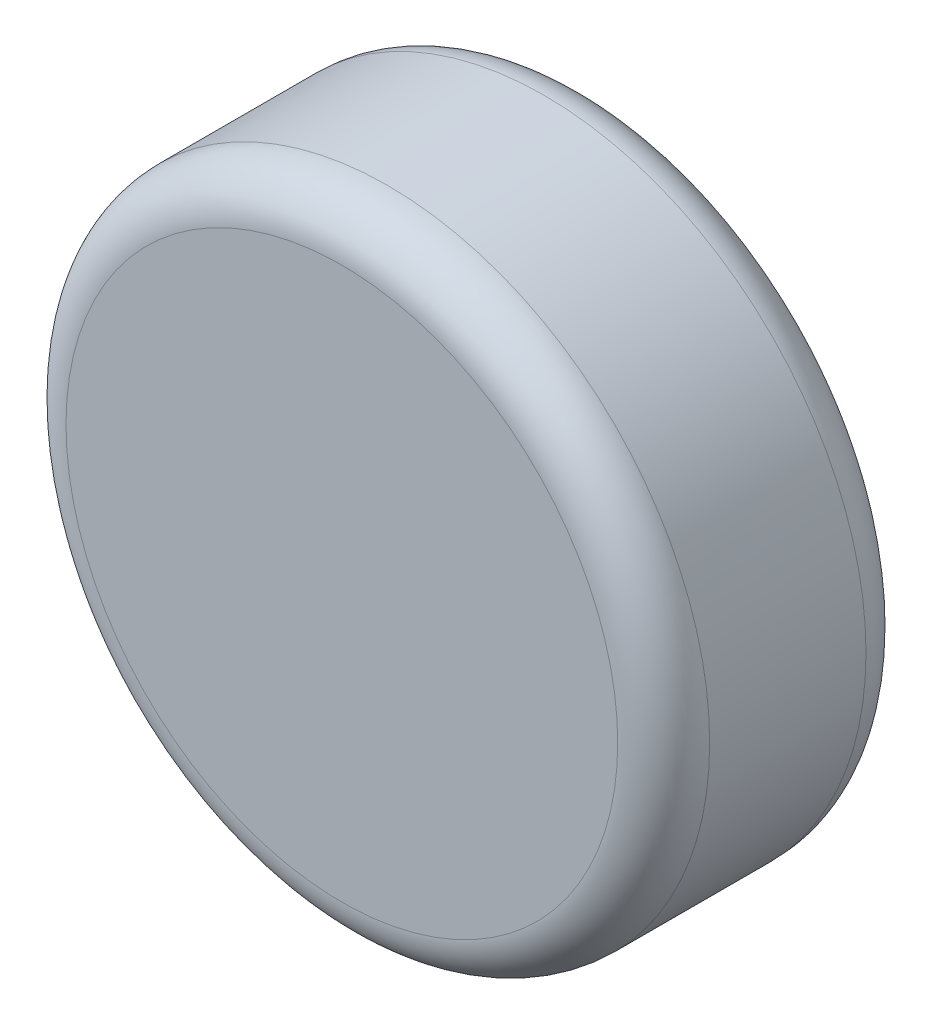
from build123d import *

# Parameters (mm, degrees)
ESQUISSE1_R        = 35
BOSS_EXTRU_1_DEPTH = 27
ESQUISSE2_R        = 7
BOSS_EXTRU_2_DEPTH = 4
CONG_1_R           = 5


with BuildPart() as part:
    # Esquisse1 → Boss.-Extru.1 (new body)
    with BuildSketch(Plane.XY):
        Circle(ESQUISSE1_R)
    extrude(amount=BOSS_EXTRU_1_DEPTH)

    # Esquisse2 → Boss.-Extru.2 (add)
    with BuildSketch(Plane(origin=(0, 0, 0), x_dir=(-1, 0, 0), z_dir=(0, 0, -1))):
        with Locations(Location((0, 0, 0), (0, 0, 180))):
            Circle(ESQUISSE2_R)
        with BuildLine():
            Line((0, 2), (2, 0))
            ThreePointArc((2, 0), (1.414213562, -1.414213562), (0, -2))
            Line((0, -2), (-2, 0))
            ThreePointArc((-2, 0), (-1.414213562, 1.414213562), (0, 2))
        make_face(mode=Mode.SUBTRACT)
    extrude(amount=BOSS_EXTRU_2_DEPTH)

    # Cong_1
    cong_1_edges = [part.edges().sort_by_distance(p)[0] for p in [
        (-35, 0, 0),
        (-35, 0, 27),
    ]]
    fillet(cong_1_edges, radius=CONG_1_R)


solid = part.part
